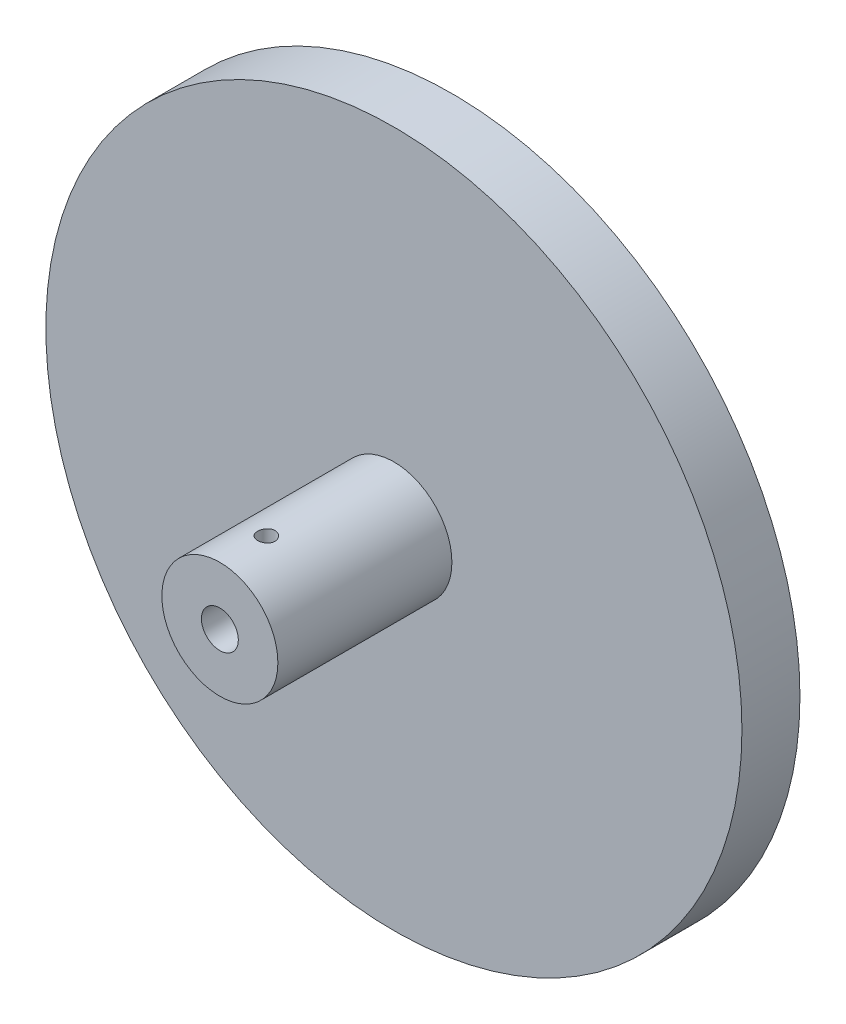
from build123d import *

# Parameters (mm, degrees)
SKETCH1_R               = 60
BOSS_EXTRUDE1_DEPTH     = 10
SKETCH2_R               = 10
BOSS_EXTRUDE2_DEPTH     = 30
SKETCH3_R               = 3.18
CUT_EXTRUDE1_DEPTH      = 30
CUT_EXTRUDE2_REACH      = 106.043
CUT_EXTRUDE2_END_RADIUS = 3.18
SKETCH4_R               = 1.5


with BuildPart() as part:
    # Sketch1 → Boss-Extrude1 (new body)
    with BuildSketch(Plane.XY):
        Circle(SKETCH1_R)
    extrude(amount=BOSS_EXTRUDE1_DEPTH)

    # Sketch2 → Boss-Extrude2 (add)
    with BuildSketch(Plane.XY.offset(10)):
        Circle(SKETCH2_R)
    extrude(amount=BOSS_EXTRUDE2_DEPTH)

    # Sketch3 → Cut-Extrude1 (cut)
    with BuildSketch(Plane.XY.offset(40)):
        Circle(SKETCH3_R)
    extrude(amount=-CUT_EXTRUDE1_DEPTH, mode=Mode.SUBTRACT)

    # Cut-Extrude2: up to this cylinder (the profile starts outside it)
    cut_extrude2_end = Plane(origin=(0, 0, 32), z_dir=(0, 0, 1)) * Cylinder(CUT_EXTRUDE2_END_RADIUS, 219.446, mode=Mode.PRIVATE)
    # Sketch4 → Cut-Extrude2 (cut, up to the surface)
    with BuildSketch(Plane(origin=(0, 15, 0), x_dir=(1, 0, 0), z_dir=(0, 1, 0)), mode=Mode.PRIVATE) as cut_extrude2_sk1:
        with Locations(Location((0, -32, 0), (0, 0, 270))):
            Circle(SKETCH4_R)
    cut_extrude2_tool1 = extrude(cut_extrude2_sk1.sketch, amount=-CUT_EXTRUDE2_REACH, mode=Mode.PRIVATE) - cut_extrude2_end
    add(cut_extrude2_tool1.solids().sort_by_distance((0, 15, 32))[0], mode=Mode.SUBTRACT)


solid = part.part
